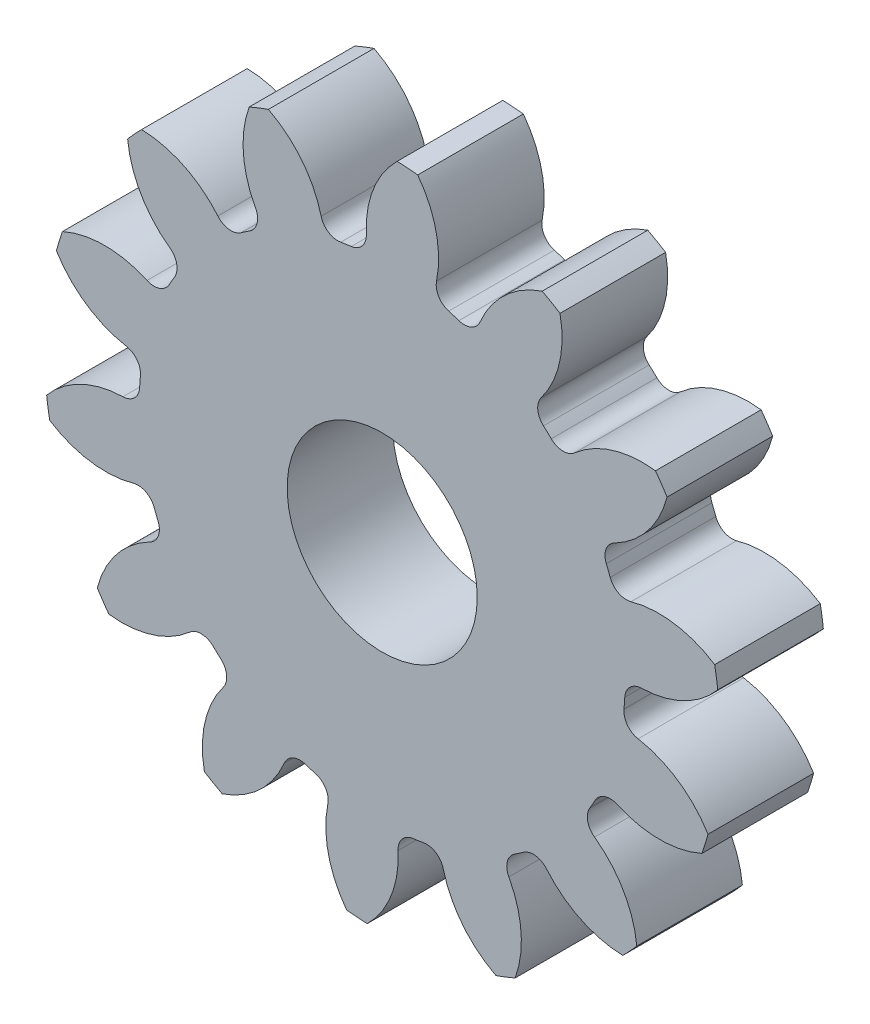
from build123d import *

# Parameters (mm, degrees)
SKETCH3_R         = 406.4
GEARBODY_DEPTH    = 127
TOOTHCUT_DEPTH    = 589.600815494
CIRPATTERN1_COUNT = 14
BOREDIA_R         = 114.3
BORE_DEPTH        = 12700


with BuildPart() as part:
    # Sketch3 → gearBody (new body)
    with BuildSketch(Plane.XY):
        Circle(SKETCH3_R)
    extrude(amount=GEARBODY_DEPTH)

    # Sketch2 → toothCut (cut, through all)
    with BuildSketch(Plane.XY):
        with BuildLine():
            ThreePointArc((290.7316031, -28.240838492), (291.281634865, -21.849924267), (291.69119747, -15.448473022))
            ThreePointArc((291.69119747, -15.448473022), (297.923048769, -1.719891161), (311.819882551, 4.127154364))
            ThreePointArc((311.819882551, 4.127154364), (364.471455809, 17.354470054), (406.4, 51.838484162))
            ThreePointArc((406.4, 51.838484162), (408.54497737, -30.646205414), (394.118390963, -111.887811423))
            ThreePointArc((394.118390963, -111.887811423), (357.803620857, -71.534527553), (307.71460718, -50.600326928))
            ThreePointArc((307.71460718, -50.600326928), (294.84559315, -42.745493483), (290.7316031, -28.240838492))
        make_face()
    toothcut = extrude(amount=TOOTHCUT_DEPTH, mode=Mode.SUBTRACT)

    # CirPattern1: toothCut ×14 about axis
    cirpattern1_axis = Axis((0, 0, 0), (0, 0, 1))
    for i in range(1, CIRPATTERN1_COUNT):
        add(toothcut.rotate(cirpattern1_axis, i * 360 / CIRPATTERN1_COUNT), mode=Mode.SUBTRACT)

    # boreDia → bore (cut, symmetric)
    with BuildSketch(Plane.XY):
        Circle(BOREDIA_R)
    extrude(amount=BORE_DEPTH, both=True, mode=Mode.SUBTRACT)


solid = part.part
